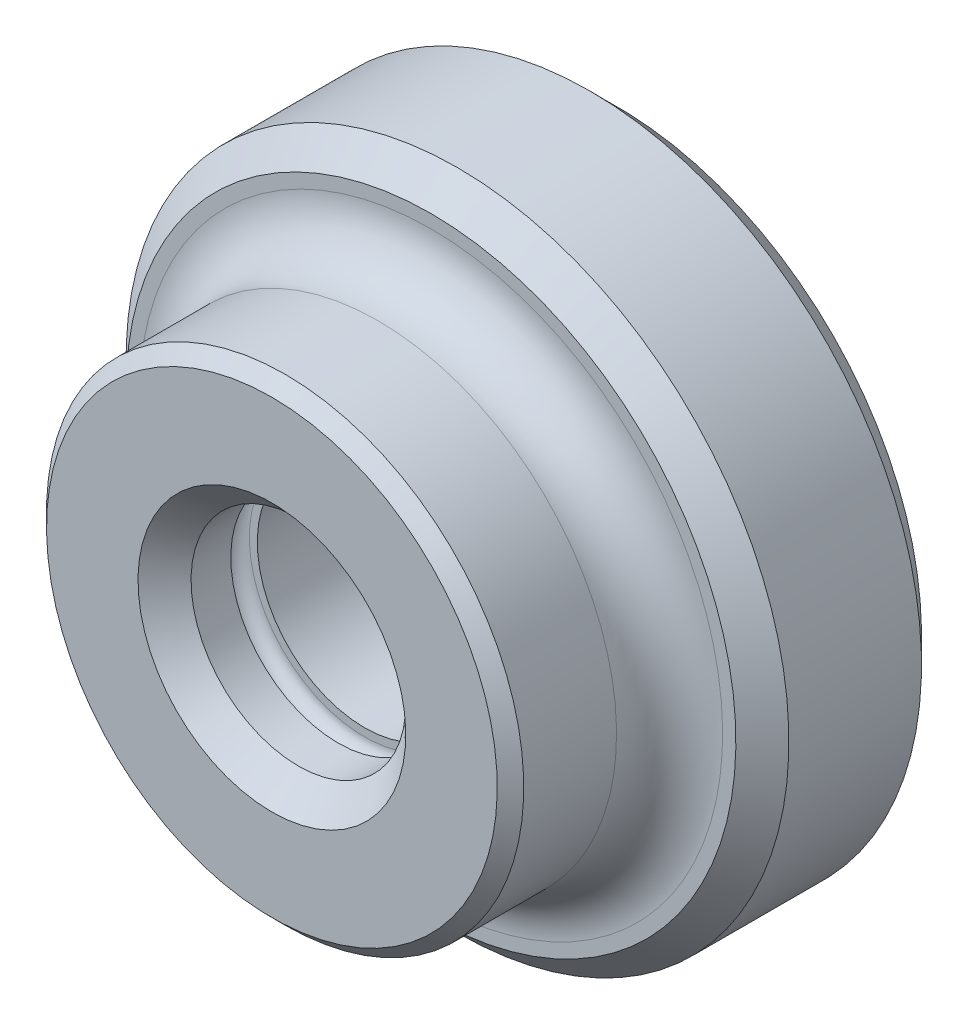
ISO-10303-21;
HEADER;
FILE_DESCRIPTION(('STEP AP214'),'2;1');
FILE_NAME('part.step','',(''),(''),'','','');
FILE_SCHEMA(('AUTOMOTIVE_DESIGN { 1 0 10303 214 1 1 1 1 }'));
ENDSEC;
DATA;
#1=APPLICATION_CONTEXT('core data for automotive mechanical design processes');
#2=APPLICATION_PROTOCOL_DEFINITION('international standard','automotive_design',2000,#1);
#3=PRODUCT_CONTEXT('',#1,'mechanical');
#4=PRODUCT('Part','Part','',(#3));
#5=PRODUCT_RELATED_PRODUCT_CATEGORY('part','',(#4));
#6=PRODUCT_DEFINITION_FORMATION('','',#4);
#7=PRODUCT_DEFINITION_CONTEXT('part definition',#1,'design');
#8=PRODUCT_DEFINITION('design','',#6,#7);
#9=PRODUCT_DEFINITION_SHAPE('','',#8);
#10=(LENGTH_UNIT() NAMED_UNIT(*) SI_UNIT(.MILLI.,.METRE.));
#11=(NAMED_UNIT(*) PLANE_ANGLE_UNIT() SI_UNIT($,.RADIAN.));
#12=(NAMED_UNIT(*) SI_UNIT($,.STERADIAN.) SOLID_ANGLE_UNIT());
#13=UNCERTAINTY_MEASURE_WITH_UNIT(LENGTH_MEASURE(1.E-05),#10,'distance_accuracy_value','');
#14=(GEOMETRIC_REPRESENTATION_CONTEXT(3) GLOBAL_UNCERTAINTY_ASSIGNED_CONTEXT((#13)) GLOBAL_UNIT_ASSIGNED_CONTEXT((#10,
#11,#12)) REPRESENTATION_CONTEXT('',''));
#15=CARTESIAN_POINT('',(0.,0.,0.));
#16=DIRECTION('',(0.,0.,1.));
#17=DIRECTION('',(1.,0.,0.));
#18=AXIS2_PLACEMENT_3D('',#15,#16,#17);
#19=CARTESIAN_POINT('',(0.,0.,5.99999999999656));
#20=DIRECTION('',(0.,0.,1.));
#21=DIRECTION('',(-1.,0.,0.));
#22=AXIS2_PLACEMENT_3D('',#19,#20,#21);
#23=CONICAL_SURFACE('',#22,4.05000000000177,1.02974425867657);
#24=CARTESIAN_POINT('',(0.,2.22044604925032E-13,3.56651449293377));
#25=VERTEX_POINT('',#24);
#26=VERTEX_LOOP('',#25);
#27=FACE_BOUND('',#26,.T.);
#28=CARTESIAN_POINT('',(0.,0.,6.));
#29=DIRECTION('',(0.,0.,1.));
#30=DIRECTION('',(0.,-1.,0.));
#31=AXIS2_PLACEMENT_3D('',#28,#29,#30);
#32=CIRCLE('',#31,4.05);
#33=CARTESIAN_POINT('',(0.,-4.05,6.));
#34=VERTEX_POINT('',#33);
#35=EDGE_CURVE('E30',#34,#34,#32,.T.);
#36=ORIENTED_EDGE('',*,*,#35,.T.);
#37=EDGE_LOOP('',(#36));
#38=FACE_BOUND('',#37,.T.);
#39=ADVANCED_FACE('F14',(#27,#38),#23,.F.);
#40=CARTESIAN_POINT('',(0.,0.,0.));
#41=DIRECTION('',(0.,0.,1.));
#42=DIRECTION('',(0.,-1.,0.));
#43=AXIS2_PLACEMENT_3D('',#40,#41,#42);
#44=CYLINDRICAL_SURFACE('',#43,4.05);
#45=ORIENTED_EDGE('',*,*,#35,.F.);
#46=EDGE_LOOP('',(#45));
#47=FACE_BOUND('',#46,.T.);
#48=CARTESIAN_POINT('',(0.,0.,9.5));
#49=DIRECTION('',(0.,0.,1.));
#50=DIRECTION('',(0.,-1.,0.));
#51=AXIS2_PLACEMENT_3D('',#48,#49,#50);
#52=CIRCLE('',#51,4.05);
#53=CARTESIAN_POINT('',(0.,-4.05,9.5));
#54=VERTEX_POINT('',#53);
#55=EDGE_CURVE('E17',#54,#54,#52,.T.);
#56=ORIENTED_EDGE('',*,*,#55,.T.);
#57=EDGE_LOOP('',(#56));
#58=FACE_BOUND('',#57,.T.);
#59=ADVANCED_FACE('F27',(#47,#58),#44,.F.);
#60=CARTESIAN_POINT('',(4.05,0.,9.5));
#61=DIRECTION('',(0.,0.,-1.));
#62=DIRECTION('',(0.,1.,0.));
#63=AXIS2_PLACEMENT_3D('',#60,#61,#62);
#64=PLANE('',#63);
#65=ORIENTED_EDGE('',*,*,#55,.F.);
#66=EDGE_LOOP('',(#65));
#67=FACE_BOUND('',#66,.T.);
#68=CARTESIAN_POINT('',(0.,0.,9.5));
#69=DIRECTION('',(0.,0.,-1.));
#70=DIRECTION('',(0.,1.,0.));
#71=AXIS2_PLACEMENT_3D('',#68,#69,#70);
#72=CIRCLE('',#71,4.35);
#73=CARTESIAN_POINT('',(0.,4.35,9.5));
#74=VERTEX_POINT('',#73);
#75=EDGE_CURVE('E34',#74,#74,#72,.F.);
#76=ORIENTED_EDGE('',*,*,#75,.T.);
#77=EDGE_LOOP('',(#76));
#78=FACE_BOUND('',#77,.T.);
#79=ADVANCED_FACE('F79',(#67,#78),#64,.F.);
#80=CARTESIAN_POINT('',(0.,0.,10.));
#81=DIRECTION('',(0.,0.,-1.));
#82=DIRECTION('',(0.,1.,0.));
#83=AXIS2_PLACEMENT_3D('',#80,#81,#82);
#84=TOROIDAL_SURFACE('',#83,4.35,0.5);
#85=ORIENTED_EDGE('',*,*,#75,.F.);
#86=EDGE_LOOP('',(#85));
#87=FACE_BOUND('',#86,.T.);
#88=CARTESIAN_POINT('',(0.,0.,10.5));
#89=DIRECTION('',(0.,0.,1.));
#90=DIRECTION('',(0.,1.,0.));
#91=AXIS2_PLACEMENT_3D('',#88,#89,#90);
#92=CIRCLE('',#91,4.35);
#93=CARTESIAN_POINT('',(0.,4.35,10.5));
#94=VERTEX_POINT('',#93);
#95=EDGE_CURVE('E66',#94,#94,#92,.T.);
#96=ORIENTED_EDGE('',*,*,#95,.T.);
#97=EDGE_LOOP('',(#96));
#98=FACE_BOUND('',#97,.T.);
#99=ADVANCED_FACE('F95',(#87,#98),#84,.F.);
#100=CARTESIAN_POINT('',(4.35,0.,10.5));
#101=DIRECTION('',(0.,0.,1.));
#102=DIRECTION('',(0.,-1.,0.));
#103=AXIS2_PLACEMENT_3D('',#100,#101,#102);
#104=PLANE('',#103);
#105=ORIENTED_EDGE('',*,*,#95,.F.);
#106=EDGE_LOOP('',(#105));
#107=FACE_BOUND('',#106,.T.);
#108=CARTESIAN_POINT('',(0.,0.,10.5));
#109=DIRECTION('',(0.,0.,1.));
#110=DIRECTION('',(0.,-1.,0.));
#111=AXIS2_PLACEMENT_3D('',#108,#109,#110);
#112=CIRCLE('',#111,4.05);
#113=CARTESIAN_POINT('',(0.,-4.05,10.5));
#114=VERTEX_POINT('',#113);
#115=EDGE_CURVE('E64',#114,#114,#112,.T.);
#116=ORIENTED_EDGE('',*,*,#115,.T.);
#117=EDGE_LOOP('',(#116));
#118=FACE_BOUND('',#117,.T.);
#119=ADVANCED_FACE('F174',(#107,#118),#104,.F.);
#120=CARTESIAN_POINT('',(0.,0.,0.));
#121=DIRECTION('',(0.,0.,1.));
#122=DIRECTION('',(0.,-1.,0.));
#123=AXIS2_PLACEMENT_3D('',#120,#121,#122);
#124=CYLINDRICAL_SURFACE('',#123,4.05);
#125=ORIENTED_EDGE('',*,*,#115,.F.);
#126=EDGE_LOOP('',(#125));
#127=FACE_BOUND('',#126,.T.);
#128=CARTESIAN_POINT('',(0.,0.,12.0000000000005));
#129=DIRECTION('',(0.,0.,1.));
#130=DIRECTION('',(0.,-1.,0.));
#131=AXIS2_PLACEMENT_3D('',#128,#129,#130);
#132=CIRCLE('',#131,4.05000000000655);
#133=CARTESIAN_POINT('',(0.,-4.05000000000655,12.0000000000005));
#134=VERTEX_POINT('',#133);
#135=EDGE_CURVE('E63',#134,#134,#132,.T.);
#136=ORIENTED_EDGE('',*,*,#135,.T.);
#137=EDGE_LOOP('',(#136));
#138=FACE_BOUND('',#137,.T.);
#139=ADVANCED_FACE('F183',(#127,#138),#124,.F.);
#140=CARTESIAN_POINT('',(0.,0.,12.99999999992));
#141=DIRECTION('',(0.,0.,1.));
#142=DIRECTION('',(0.,-1.,0.));
#143=AXIS2_PLACEMENT_3D('',#140,#141,#142);
#144=CONICAL_SURFACE('',#143,5.04999999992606,0.785398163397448);
#145=ORIENTED_EDGE('',*,*,#135,.F.);
#146=EDGE_LOOP('',(#145));
#147=FACE_BOUND('',#146,.T.);
#148=CARTESIAN_POINT('',(0.,0.,12.9999999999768));
#149=DIRECTION('',(0.,0.,1.));
#150=DIRECTION('',(0.,-1.,0.));
#151=AXIS2_PLACEMENT_3D('',#148,#149,#150);
#152=CIRCLE('',#151,5.0499999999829);
#153=CARTESIAN_POINT('',(0.,-5.0499999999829,12.9999999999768));
#154=VERTEX_POINT('',#153);
#155=EDGE_CURVE('E61',#154,#154,#152,.T.);
#156=ORIENTED_EDGE('',*,*,#155,.T.);
#157=EDGE_LOOP('',(#156));
#158=FACE_BOUND('',#157,.T.);
#159=ADVANCED_FACE('F186',(#147,#158),#144,.F.);
#160=CARTESIAN_POINT('',(5.05,0.,13.));
#161=DIRECTION('',(0.,0.,-1.));
#162=DIRECTION('',(0.,1.,0.));
#163=AXIS2_PLACEMENT_3D('',#160,#161,#162);
#164=PLANE('',#163);
#165=ORIENTED_EDGE('',*,*,#155,.F.);
#166=EDGE_LOOP('',(#165));
#167=FACE_BOUND('',#166,.T.);
#168=CARTESIAN_POINT('',(0.,0.,13.));
#169=DIRECTION('',(0.,0.,-1.));
#170=DIRECTION('',(0.,1.,0.));
#171=AXIS2_PLACEMENT_3D('',#168,#169,#170);
#172=CIRCLE('',#171,8.5);
#173=CARTESIAN_POINT('',(0.,8.5,13.));
#174=VERTEX_POINT('',#173);
#175=EDGE_CURVE('E58',#174,#174,#172,.T.);
#176=ORIENTED_EDGE('',*,*,#175,.F.);
#177=EDGE_LOOP('',(#176));
#178=FACE_BOUND('',#177,.T.);
#179=ADVANCED_FACE('F190',(#167,#178),#164,.F.);
#180=CARTESIAN_POINT('',(0.,0.,12.5));
#181=DIRECTION('',(0.,0.,-1.));
#182=DIRECTION('',(0.,1.,0.));
#183=AXIS2_PLACEMENT_3D('',#180,#181,#182);
#184=CONICAL_SURFACE('',#183,9.,0.785398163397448);
#185=ORIENTED_EDGE('',*,*,#175,.T.);
#186=EDGE_LOOP('',(#185));
#187=FACE_BOUND('',#186,.T.);
#188=CARTESIAN_POINT('',(0.,0.,12.5));
#189=DIRECTION('',(0.,0.,1.));
#190=DIRECTION('',(0.,-1.,0.));
#191=AXIS2_PLACEMENT_3D('',#188,#189,#190);
#192=CIRCLE('',#191,9.);
#193=CARTESIAN_POINT('',(0.,-9.,12.5));
#194=VERTEX_POINT('',#193);
#195=EDGE_CURVE('E57',#194,#194,#192,.F.);
#196=ORIENTED_EDGE('',*,*,#195,.F.);
#197=EDGE_LOOP('',(#196));
#198=FACE_BOUND('',#197,.T.);
#199=ADVANCED_FACE('F194',(#187,#198),#184,.T.);
#200=CARTESIAN_POINT('',(0.,0.,0.5));
#201=DIRECTION('',(0.,0.,-1.));
#202=DIRECTION('',(0.,1.,0.));
#203=AXIS2_PLACEMENT_3D('',#200,#201,#202);
#204=PLANE('',#203);
#205=CARTESIAN_POINT('',(0.,0.,0.5));
#206=DIRECTION('',(0.,0.,1.));
#207=DIRECTION('',(0.,-1.,0.));
#208=AXIS2_PLACEMENT_3D('',#205,#206,#207);
#209=CIRCLE('',#208,5.);
#210=CARTESIAN_POINT('',(0.,-5.,0.5));
#211=VERTEX_POINT('',#210);
#212=EDGE_CURVE('E54',#211,#211,#209,.F.);
#213=ORIENTED_EDGE('',*,*,#212,.T.);
#214=EDGE_LOOP('',(#213));
#215=FACE_BOUND('',#214,.T.);
#216=ADVANCED_FACE('F198',(#215),#204,.T.);
#217=CARTESIAN_POINT('',(0.,0.,0.));
#218=DIRECTION('',(0.,0.,1.));
#219=DIRECTION('',(0.,-1.,0.));
#220=AXIS2_PLACEMENT_3D('',#217,#218,#219);
#221=CYLINDRICAL_SURFACE('',#220,9.);
#222=ORIENTED_EDGE('',*,*,#195,.T.);
#223=EDGE_LOOP('',(#222));
#224=FACE_BOUND('',#223,.T.);
#225=CARTESIAN_POINT('',(0.,0.,9.));
#226=DIRECTION('',(0.,0.,-1.));
#227=DIRECTION('',(0.,1.,0.));
#228=AXIS2_PLACEMENT_3D('',#225,#226,#227);
#229=CIRCLE('',#228,9.);
#230=CARTESIAN_POINT('',(0.,9.,9.));
#231=VERTEX_POINT('',#230);
#232=EDGE_CURVE('E53',#231,#231,#229,.F.);
#233=ORIENTED_EDGE('',*,*,#232,.T.);
#234=EDGE_LOOP('',(#233));
#235=FACE_BOUND('',#234,.T.);
#236=ADVANCED_FACE('F201',(#224,#235),#221,.T.);
#237=CARTESIAN_POINT('',(0.,0.,0.));
#238=DIRECTION('',(0.,0.,1.));
#239=DIRECTION('',(0.,-1.,0.));
#240=AXIS2_PLACEMENT_3D('',#237,#238,#239);
#241=CYLINDRICAL_SURFACE('',#240,5.);
#242=ORIENTED_EDGE('',*,*,#212,.F.);
#243=EDGE_LOOP('',(#242));
#244=FACE_BOUND('',#243,.T.);
#245=CARTESIAN_POINT('',(0.,0.,0.));
#246=DIRECTION('',(0.,0.,1.));
#247=DIRECTION('',(0.,-1.,0.));
#248=AXIS2_PLACEMENT_3D('',#245,#246,#247);
#249=CIRCLE('',#248,5.);
#250=CARTESIAN_POINT('',(0.,-5.,0.));
#251=VERTEX_POINT('',#250);
#252=EDGE_CURVE('E50',#251,#251,#249,.F.);
#253=ORIENTED_EDGE('',*,*,#252,.T.);
#254=EDGE_LOOP('',(#253));
#255=FACE_BOUND('',#254,.T.);
#256=ADVANCED_FACE('F149',(#244,#255),#241,.F.);
#257=CARTESIAN_POINT('',(0.,0.,9.));
#258=DIRECTION('',(0.,0.,-1.));
#259=DIRECTION('',(0.,1.,0.));
#260=AXIS2_PLACEMENT_3D('',#257,#258,#259);
#261=TOROIDAL_SURFACE('',#260,11.,2.);
#262=ORIENTED_EDGE('',*,*,#232,.F.);
#263=EDGE_LOOP('',(#262));
#264=FACE_BOUND('',#263,.T.);
#265=CARTESIAN_POINT('',(0.,0.,7.));
#266=DIRECTION('',(0.,0.,1.));
#267=DIRECTION('',(0.,1.,0.));
#268=AXIS2_PLACEMENT_3D('',#265,#266,#267);
#269=CIRCLE('',#268,11.);
#270=CARTESIAN_POINT('',(0.,11.,7.));
#271=VERTEX_POINT('',#270);
#272=EDGE_CURVE('E49',#271,#271,#269,.T.);
#273=ORIENTED_EDGE('',*,*,#272,.T.);
#274=EDGE_LOOP('',(#273));
#275=FACE_BOUND('',#274,.T.);
#276=ADVANCED_FACE('F145',(#264,#275),#261,.F.);
#277=CARTESIAN_POINT('',(11.5,0.,0.));
#278=DIRECTION('',(0.,0.,1.));
#279=DIRECTION('',(0.,-1.,0.));
#280=AXIS2_PLACEMENT_3D('',#277,#278,#279);
#281=PLANE('',#280);
#282=CARTESIAN_POINT('',(0.,0.,0.));
#283=DIRECTION('',(0.,0.,1.));
#284=DIRECTION('',(0.,-1.,0.));
#285=AXIS2_PLACEMENT_3D('',#282,#283,#284);
#286=CIRCLE('',#285,11.5);
#287=CARTESIAN_POINT('',(0.,-11.5,0.));
#288=VERTEX_POINT('',#287);
#289=EDGE_CURVE('E46',#288,#288,#286,.T.);
#290=ORIENTED_EDGE('',*,*,#289,.F.);
#291=EDGE_LOOP('',(#290));
#292=FACE_BOUND('',#291,.T.);
#293=ORIENTED_EDGE('',*,*,#252,.F.);
#294=EDGE_LOOP('',(#293));
#295=FACE_BOUND('',#294,.T.);
#296=ADVANCED_FACE('F127',(#292,#295),#281,.F.);
#297=CARTESIAN_POINT('',(11.,0.,7.));
#298=DIRECTION('',(0.,0.,-1.));
#299=DIRECTION('',(0.,1.,0.));
#300=AXIS2_PLACEMENT_3D('',#297,#298,#299);
#301=PLANE('',#300);
#302=ORIENTED_EDGE('',*,*,#272,.F.);
#303=EDGE_LOOP('',(#302));
#304=FACE_BOUND('',#303,.T.);
#305=CARTESIAN_POINT('',(0.,0.,7.));
#306=DIRECTION('',(0.,0.,-1.));
#307=DIRECTION('',(0.,1.,0.));
#308=AXIS2_PLACEMENT_3D('',#305,#306,#307);
#309=CIRCLE('',#308,11.5);
#310=CARTESIAN_POINT('',(0.,11.5,7.));
#311=VERTEX_POINT('',#310);
#312=EDGE_CURVE('E43',#311,#311,#309,.T.);
#313=ORIENTED_EDGE('',*,*,#312,.F.);
#314=EDGE_LOOP('',(#313));
#315=FACE_BOUND('',#314,.T.);
#316=ADVANCED_FACE('F122',(#304,#315),#301,.F.);
#317=CARTESIAN_POINT('',(0.,0.,1.));
#318=DIRECTION('',(0.,0.,1.));
#319=DIRECTION('',(0.,-1.,0.));
#320=AXIS2_PLACEMENT_3D('',#317,#318,#319);
#321=CONICAL_SURFACE('',#320,12.5,0.785398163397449);
#322=CARTESIAN_POINT('',(0.,0.,1.));
#323=DIRECTION('',(0.,0.,1.));
#324=DIRECTION('',(0.,-1.,0.));
#325=AXIS2_PLACEMENT_3D('',#322,#323,#324);
#326=CIRCLE('',#325,12.5);
#327=CARTESIAN_POINT('',(0.,-12.5,1.));
#328=VERTEX_POINT('',#327);
#329=EDGE_CURVE('E21',#328,#328,#326,.T.);
#330=ORIENTED_EDGE('',*,*,#329,.F.);
#331=EDGE_LOOP('',(#330));
#332=FACE_BOUND('',#331,.T.);
#333=ORIENTED_EDGE('',*,*,#289,.T.);
#334=EDGE_LOOP('',(#333));
#335=FACE_BOUND('',#334,.T.);
#336=ADVANCED_FACE('F115',(#332,#335),#321,.T.);
#337=CARTESIAN_POINT('',(0.,0.,6.));
#338=DIRECTION('',(0.,0.,-1.));
#339=DIRECTION('',(0.,1.,0.));
#340=AXIS2_PLACEMENT_3D('',#337,#338,#339);
#341=CONICAL_SURFACE('',#340,12.5,0.785398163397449);
#342=ORIENTED_EDGE('',*,*,#312,.T.);
#343=EDGE_LOOP('',(#342));
#344=FACE_BOUND('',#343,.T.);
#345=CARTESIAN_POINT('',(0.,0.,6.));
#346=DIRECTION('',(0.,0.,1.));
#347=DIRECTION('',(0.,-1.,0.));
#348=AXIS2_PLACEMENT_3D('',#345,#346,#347);
#349=CIRCLE('',#348,12.5);
#350=CARTESIAN_POINT('',(0.,-12.5,6.));
#351=VERTEX_POINT('',#350);
#352=EDGE_CURVE('E9',#351,#351,#349,.F.);
#353=ORIENTED_EDGE('',*,*,#352,.F.);
#354=EDGE_LOOP('',(#353));
#355=FACE_BOUND('',#354,.T.);
#356=ADVANCED_FACE('F108',(#344,#355),#341,.T.);
#357=CARTESIAN_POINT('',(0.,0.,0.));
#358=DIRECTION('',(0.,0.,1.));
#359=DIRECTION('',(0.,-1.,0.));
#360=AXIS2_PLACEMENT_3D('',#357,#358,#359);
#361=CYLINDRICAL_SURFACE('',#360,12.5);
#362=ORIENTED_EDGE('',*,*,#352,.T.);
#363=EDGE_LOOP('',(#362));
#364=FACE_BOUND('',#363,.T.);
#365=ORIENTED_EDGE('',*,*,#329,.T.);
#366=EDGE_LOOP('',(#365));
#367=FACE_BOUND('',#366,.T.);
#368=ADVANCED_FACE('F106',(#364,#367),#361,.T.);
#369=CLOSED_SHELL('',(#39,#59,#79,#99,#119,#139,#159,#179,#199,#216,#236,#256,#276,#296,#316,
#336,#356,#368));
#370=MANIFOLD_SOLID_BREP('B1',#369);
#371=ADVANCED_BREP_SHAPE_REPRESENTATION('',(#18,#370),#14);
#372=SHAPE_DEFINITION_REPRESENTATION(#9,#371);
ENDSEC;
END-ISO-10303-21;
